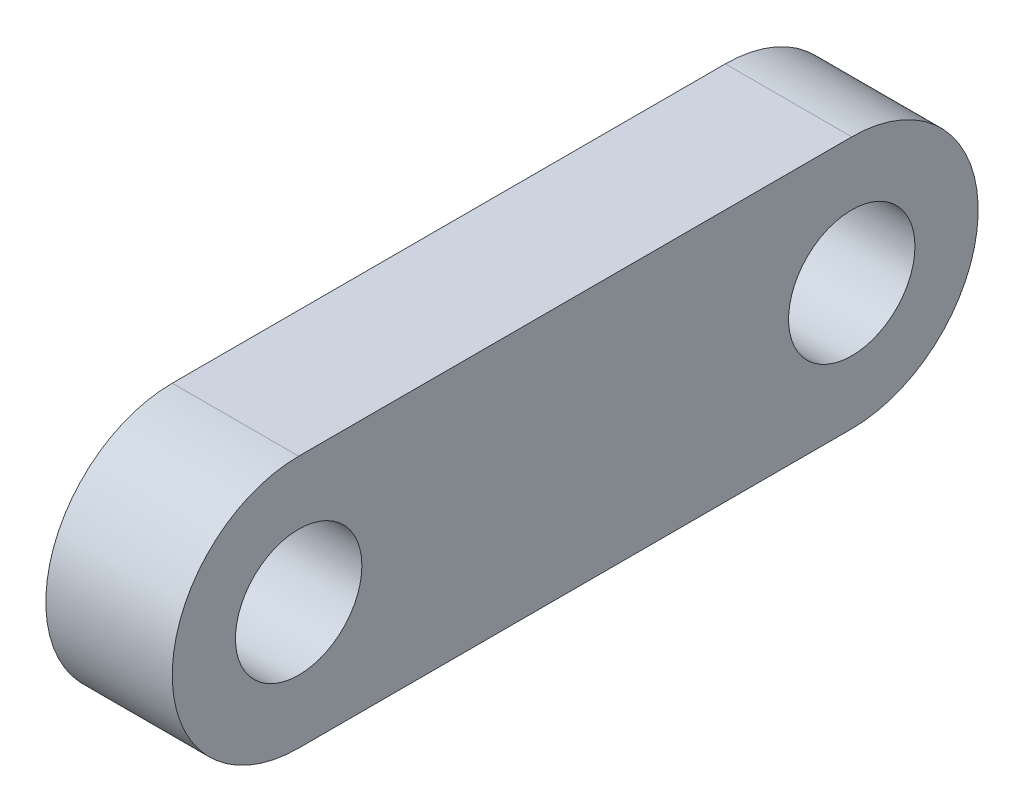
ISO-10303-21;
HEADER;
FILE_DESCRIPTION(('STEP AP214'),'2;1');
FILE_NAME('part.step','',(''),(''),'','','');
FILE_SCHEMA(('AUTOMOTIVE_DESIGN { 1 0 10303 214 1 1 1 1 }'));
ENDSEC;
DATA;
#1=APPLICATION_CONTEXT('core data for automotive mechanical design processes');
#2=APPLICATION_PROTOCOL_DEFINITION('international standard','automotive_design',2000,#1);
#3=PRODUCT_CONTEXT('',#1,'mechanical');
#4=PRODUCT('Part','Part','',(#3));
#5=PRODUCT_RELATED_PRODUCT_CATEGORY('part','',(#4));
#6=PRODUCT_DEFINITION_FORMATION('','',#4);
#7=PRODUCT_DEFINITION_CONTEXT('part definition',#1,'design');
#8=PRODUCT_DEFINITION('design','',#6,#7);
#9=PRODUCT_DEFINITION_SHAPE('','',#8);
#10=(LENGTH_UNIT() NAMED_UNIT(*) SI_UNIT(.MILLI.,.METRE.));
#11=(NAMED_UNIT(*) PLANE_ANGLE_UNIT() SI_UNIT($,.RADIAN.));
#12=(NAMED_UNIT(*) SI_UNIT($,.STERADIAN.) SOLID_ANGLE_UNIT());
#13=UNCERTAINTY_MEASURE_WITH_UNIT(LENGTH_MEASURE(1.E-05),#10,'distance_accuracy_value','');
#14=(GEOMETRIC_REPRESENTATION_CONTEXT(3) GLOBAL_UNCERTAINTY_ASSIGNED_CONTEXT((#13)) GLOBAL_UNIT_ASSIGNED_CONTEXT((#10,
#11,#12)) REPRESENTATION_CONTEXT('',''));
#15=CARTESIAN_POINT('',(0.,0.,0.));
#16=DIRECTION('',(0.,0.,1.));
#17=DIRECTION('',(1.,0.,0.));
#18=AXIS2_PLACEMENT_3D('',#15,#16,#17);
#19=CARTESIAN_POINT('',(20.,0.,87.5));
#20=DIRECTION('',(1.,0.,0.));
#21=DIRECTION('',(0.,0.,-1.));
#22=AXIS2_PLACEMENT_3D('',#19,#20,#21);
#23=PLANE('',#22);
#24=CARTESIAN_POINT('',(20.,0.,87.5));
#25=DIRECTION('',(1.,0.,0.));
#26=DIRECTION('',(0.,0.,-1.));
#27=AXIS2_PLACEMENT_3D('',#24,#25,#26);
#28=CIRCLE('',#27,20.);
#29=CARTESIAN_POINT('',(20.,0.,67.5));
#30=VERTEX_POINT('',#29);
#31=EDGE_CURVE('E105',#30,#30,#28,.T.);
#32=ORIENTED_EDGE('',*,*,#31,.F.);
#33=EDGE_LOOP('',(#32));
#34=FACE_BOUND('',#33,.T.);
#35=CARTESIAN_POINT('',(20.,0.,87.5));
#36=DIRECTION('',(1.,0.,0.));
#37=DIRECTION('',(0.,0.,-1.));
#38=AXIS2_PLACEMENT_3D('',#35,#36,#37);
#39=CIRCLE('',#38,40.);
#40=CARTESIAN_POINT('',(20.,40.,87.5));
#41=VERTEX_POINT('',#40);
#42=CARTESIAN_POINT('',(20.,-40.,87.5));
#43=VERTEX_POINT('',#42);
#44=EDGE_CURVE('E90',#41,#43,#39,.T.);
#45=ORIENTED_EDGE('',*,*,#44,.T.);
#46=DIRECTION('',(0.,0.,-1.));
#47=VECTOR('',#46,1.);
#48=CARTESIAN_POINT('',(20.,-40.,87.5));
#49=LINE('',#48,#47);
#50=CARTESIAN_POINT('',(20.,-40.,-87.5));
#51=VERTEX_POINT('',#50);
#52=EDGE_CURVE('E85',#43,#51,#49,.T.);
#53=ORIENTED_EDGE('',*,*,#52,.T.);
#54=CARTESIAN_POINT('',(20.,0.,-87.5));
#55=DIRECTION('',(1.,0.,0.));
#56=DIRECTION('',(0.,0.,-1.));
#57=AXIS2_PLACEMENT_3D('',#54,#55,#56);
#58=CIRCLE('',#57,40.);
#59=CARTESIAN_POINT('',(20.,40.,-87.5));
#60=VERTEX_POINT('',#59);
#61=EDGE_CURVE('E88',#51,#60,#58,.T.);
#62=ORIENTED_EDGE('',*,*,#61,.T.);
#63=DIRECTION('',(0.,0.,1.));
#64=VECTOR('',#63,1.);
#65=CARTESIAN_POINT('',(20.,40.,87.5));
#66=LINE('',#65,#64);
#67=EDGE_CURVE('E55',#60,#41,#66,.T.);
#68=ORIENTED_EDGE('',*,*,#67,.T.);
#69=EDGE_LOOP('',(#45,#53,#62,#68));
#70=FACE_BOUND('',#69,.T.);
#71=CARTESIAN_POINT('',(20.,0.,-87.5));
#72=DIRECTION('',(1.,0.,0.));
#73=DIRECTION('',(0.,0.,-1.));
#74=AXIS2_PLACEMENT_3D('',#71,#72,#73);
#75=CIRCLE('',#74,20.);
#76=CARTESIAN_POINT('',(20.,0.,-107.5));
#77=VERTEX_POINT('',#76);
#78=EDGE_CURVE('E120',#77,#77,#75,.T.);
#79=ORIENTED_EDGE('',*,*,#78,.F.);
#80=EDGE_LOOP('',(#79));
#81=FACE_BOUND('',#80,.T.);
#82=ADVANCED_FACE('F38',(#34,#70,#81),#23,.T.);
#83=CARTESIAN_POINT('',(-20.,0.,87.5));
#84=DIRECTION('',(1.,0.,0.));
#85=DIRECTION('',(0.,0.,-1.));
#86=AXIS2_PLACEMENT_3D('',#83,#84,#85);
#87=PLANE('',#86);
#88=CARTESIAN_POINT('',(-20.,0.,87.5));
#89=DIRECTION('',(1.,0.,0.));
#90=DIRECTION('',(0.,0.,-1.));
#91=AXIS2_PLACEMENT_3D('',#88,#89,#90);
#92=CIRCLE('',#91,40.);
#93=CARTESIAN_POINT('',(-20.,40.,87.5));
#94=VERTEX_POINT('',#93);
#95=CARTESIAN_POINT('',(-20.,-40.,87.5));
#96=VERTEX_POINT('',#95);
#97=EDGE_CURVE('E102',#94,#96,#92,.T.);
#98=ORIENTED_EDGE('',*,*,#97,.F.);
#99=DIRECTION('',(0.,0.,1.));
#100=VECTOR('',#99,1.);
#101=CARTESIAN_POINT('',(-20.,40.,87.5));
#102=LINE('',#101,#100);
#103=CARTESIAN_POINT('',(-20.,40.,-87.5));
#104=VERTEX_POINT('',#103);
#105=EDGE_CURVE('E78',#104,#94,#102,.T.);
#106=ORIENTED_EDGE('',*,*,#105,.F.);
#107=CARTESIAN_POINT('',(-20.,0.,-87.5));
#108=DIRECTION('',(1.,0.,0.));
#109=DIRECTION('',(0.,0.,-1.));
#110=AXIS2_PLACEMENT_3D('',#107,#108,#109);
#111=CIRCLE('',#110,40.);
#112=CARTESIAN_POINT('',(-20.,-40.,-87.5));
#113=VERTEX_POINT('',#112);
#114=EDGE_CURVE('E72',#113,#104,#111,.T.);
#115=ORIENTED_EDGE('',*,*,#114,.F.);
#116=DIRECTION('',(0.,0.,-1.));
#117=VECTOR('',#116,1.);
#118=CARTESIAN_POINT('',(-20.,-40.,87.5));
#119=LINE('',#118,#117);
#120=EDGE_CURVE('E94',#96,#113,#119,.T.);
#121=ORIENTED_EDGE('',*,*,#120,.F.);
#122=EDGE_LOOP('',(#98,#106,#115,#121));
#123=FACE_BOUND('',#122,.T.);
#124=CARTESIAN_POINT('',(-20.,0.,87.5));
#125=DIRECTION('',(1.,0.,0.));
#126=DIRECTION('',(0.,0.,-1.));
#127=AXIS2_PLACEMENT_3D('',#124,#125,#126);
#128=CIRCLE('',#127,20.);
#129=CARTESIAN_POINT('',(-20.,0.,67.5));
#130=VERTEX_POINT('',#129);
#131=EDGE_CURVE('E117',#130,#130,#128,.T.);
#132=ORIENTED_EDGE('',*,*,#131,.T.);
#133=EDGE_LOOP('',(#132));
#134=FACE_BOUND('',#133,.T.);
#135=CARTESIAN_POINT('',(-20.,0.,-87.5));
#136=DIRECTION('',(1.,0.,0.));
#137=DIRECTION('',(0.,0.,-1.));
#138=AXIS2_PLACEMENT_3D('',#135,#136,#137);
#139=CIRCLE('',#138,20.);
#140=CARTESIAN_POINT('',(-20.,0.,-107.5));
#141=VERTEX_POINT('',#140);
#142=EDGE_CURVE('E123',#141,#141,#139,.T.);
#143=ORIENTED_EDGE('',*,*,#142,.T.);
#144=EDGE_LOOP('',(#143));
#145=FACE_BOUND('',#144,.T.);
#146=ADVANCED_FACE('F113',(#123,#134,#145),#87,.F.);
#147=CARTESIAN_POINT('',(20.,0.,87.5));
#148=DIRECTION('',(-1.,0.,0.));
#149=DIRECTION('',(0.,0.,1.));
#150=AXIS2_PLACEMENT_3D('',#147,#148,#149);
#151=CYLINDRICAL_SURFACE('',#150,40.);
#152=ORIENTED_EDGE('',*,*,#97,.T.);
#153=DIRECTION('',(-1.,0.,0.));
#154=VECTOR('',#153,1.);
#155=CARTESIAN_POINT('',(20.,-40.,87.5));
#156=LINE('',#155,#154);
#157=EDGE_CURVE('E11',#43,#96,#156,.T.);
#158=ORIENTED_EDGE('',*,*,#157,.F.);
#159=ORIENTED_EDGE('',*,*,#44,.F.);
#160=DIRECTION('',(-1.,0.,0.));
#161=VECTOR('',#160,1.);
#162=CARTESIAN_POINT('',(20.,40.,87.5));
#163=LINE('',#162,#161);
#164=EDGE_CURVE('E98',#41,#94,#163,.T.);
#165=ORIENTED_EDGE('',*,*,#164,.T.);
#166=EDGE_LOOP('',(#152,#158,#159,#165));
#167=FACE_BOUND('',#166,.T.);
#168=ADVANCED_FACE('F40',(#167),#151,.T.);
#169=CARTESIAN_POINT('',(20.,-40.,87.5));
#170=DIRECTION('',(0.,1.,0.));
#171=DIRECTION('',(0.,0.,1.));
#172=AXIS2_PLACEMENT_3D('',#169,#170,#171);
#173=PLANE('',#172);
#174=ORIENTED_EDGE('',*,*,#120,.T.);
#175=DIRECTION('',(-1.,0.,0.));
#176=VECTOR('',#175,1.);
#177=CARTESIAN_POINT('',(20.,-40.,-87.5));
#178=LINE('',#177,#176);
#179=EDGE_CURVE('E47',#51,#113,#178,.T.);
#180=ORIENTED_EDGE('',*,*,#179,.F.);
#181=ORIENTED_EDGE('',*,*,#52,.F.);
#182=ORIENTED_EDGE('',*,*,#157,.T.);
#183=EDGE_LOOP('',(#174,#180,#181,#182));
#184=FACE_BOUND('',#183,.T.);
#185=ADVANCED_FACE('F93',(#184),#173,.F.);
#186=CARTESIAN_POINT('',(20.,0.,-87.5));
#187=DIRECTION('',(-1.,0.,0.));
#188=DIRECTION('',(0.,0.,1.));
#189=AXIS2_PLACEMENT_3D('',#186,#187,#188);
#190=CYLINDRICAL_SURFACE('',#189,40.);
#191=ORIENTED_EDGE('',*,*,#114,.T.);
#192=DIRECTION('',(-1.,0.,0.));
#193=VECTOR('',#192,1.);
#194=CARTESIAN_POINT('',(20.,40.,-87.5));
#195=LINE('',#194,#193);
#196=EDGE_CURVE('E95',#60,#104,#195,.T.);
#197=ORIENTED_EDGE('',*,*,#196,.F.);
#198=ORIENTED_EDGE('',*,*,#61,.F.);
#199=ORIENTED_EDGE('',*,*,#179,.T.);
#200=EDGE_LOOP('',(#191,#197,#198,#199));
#201=FACE_BOUND('',#200,.T.);
#202=ADVANCED_FACE('F96',(#201),#190,.T.);
#203=CARTESIAN_POINT('',(20.,40.,87.5));
#204=DIRECTION('',(0.,-1.,0.));
#205=DIRECTION('',(0.,0.,-1.));
#206=AXIS2_PLACEMENT_3D('',#203,#204,#205);
#207=PLANE('',#206);
#208=ORIENTED_EDGE('',*,*,#105,.T.);
#209=ORIENTED_EDGE('',*,*,#164,.F.);
#210=ORIENTED_EDGE('',*,*,#67,.F.);
#211=ORIENTED_EDGE('',*,*,#196,.T.);
#212=EDGE_LOOP('',(#208,#209,#210,#211));
#213=FACE_BOUND('',#212,.T.);
#214=ADVANCED_FACE('F110',(#213),#207,.F.);
#215=CARTESIAN_POINT('',(20.,0.,87.5));
#216=DIRECTION('',(-1.,0.,0.));
#217=DIRECTION('',(0.,0.,1.));
#218=AXIS2_PLACEMENT_3D('',#215,#216,#217);
#219=CYLINDRICAL_SURFACE('',#218,20.);
#220=ORIENTED_EDGE('',*,*,#31,.T.);
#221=EDGE_LOOP('',(#220));
#222=FACE_BOUND('',#221,.T.);
#223=ORIENTED_EDGE('',*,*,#131,.F.);
#224=EDGE_LOOP('',(#223));
#225=FACE_BOUND('',#224,.T.);
#226=ADVANCED_FACE('F140',(#222,#225),#219,.F.);
#227=CARTESIAN_POINT('',(20.,0.,-87.5));
#228=DIRECTION('',(-1.,0.,0.));
#229=DIRECTION('',(0.,0.,1.));
#230=AXIS2_PLACEMENT_3D('',#227,#228,#229);
#231=CYLINDRICAL_SURFACE('',#230,20.);
#232=ORIENTED_EDGE('',*,*,#78,.T.);
#233=EDGE_LOOP('',(#232));
#234=FACE_BOUND('',#233,.T.);
#235=ORIENTED_EDGE('',*,*,#142,.F.);
#236=EDGE_LOOP('',(#235));
#237=FACE_BOUND('',#236,.T.);
#238=ADVANCED_FACE('F129',(#234,#237),#231,.F.);
#239=CLOSED_SHELL('',(#82,#146,#168,#185,#202,#214,#226,#238));
#240=MANIFOLD_SOLID_BREP('B2',#239);
#241=ADVANCED_BREP_SHAPE_REPRESENTATION('',(#18,#240),#14);
#242=SHAPE_DEFINITION_REPRESENTATION(#9,#241);
ENDSEC;
END-ISO-10303-21;
